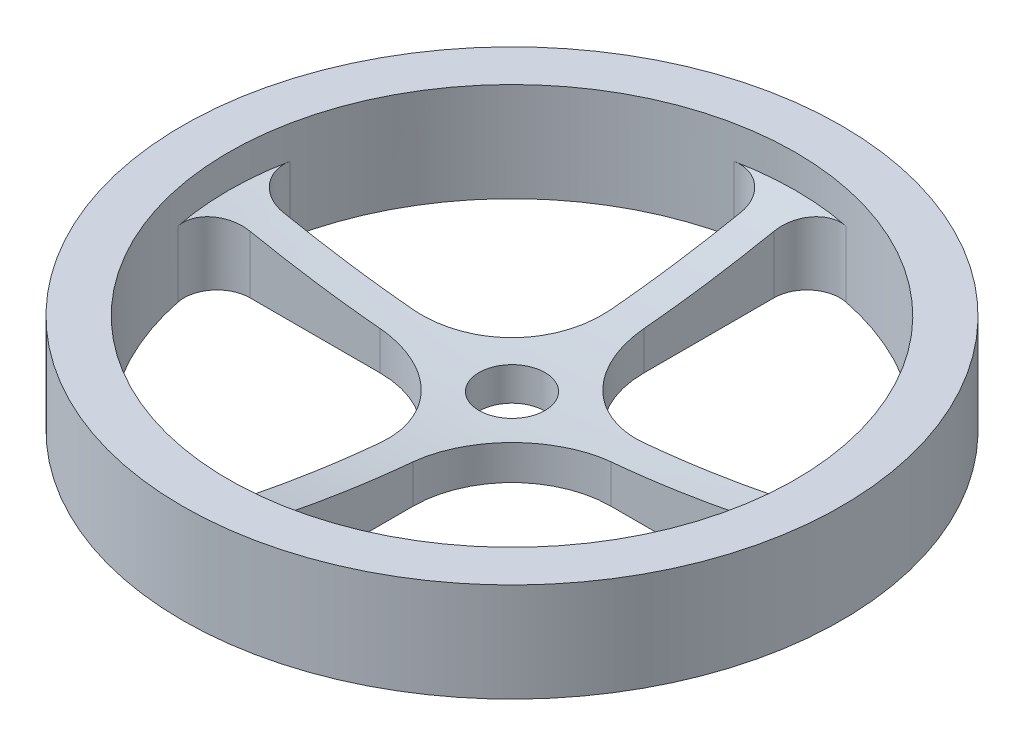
from build123d import *
from build123d.topology import SkipClean

# Parameters (mm, degrees)
SKETCH1_R          = 12.7
THREAD_BLANK_DEPTH = 3.81
VENT_DEPTH         = 19.360177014
SKETCH6_R          = 1.27
CENTER_HOLE_DEPTH  = 19.360177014


with BuildPart() as part:
    # Sketch1 → Thread Blank (new body)
    with BuildSketch(Plane(origin=(0, 0, 0), x_dir=(1, 0, 0), z_dir=(0, 1, 0))):
        with Locations(Location((0, 0, 0), (0, 0, 90))):
            Circle(SKETCH1_R)
    extrude(amount=THREAD_BLANK_DEPTH)

    # Sketch4 → Center Depression (revolve, cut)
    with BuildSketch(Plane.XY, mode=Mode.PRIVATE) as center_depression_sk:
        with BuildLine():
            Line((0, 3.81), (10.922, 3.81))
            Line((10.922, 3.81), (10.922, 2.54))
            ThreePointArc((10.922, 2.54), (5.497794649, 1.588566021), (0, 1.27))
            Line((0, 1.27), (0, 3.81))
        make_face()
    revolve(center_depression_sk.sketch.rotate(Axis((0, 0, 0), (0, 1, 0)), 90), axis=Axis((0, 0, 0), (0, 1, 0)), mode=Mode.SUBTRACT)

    # Sketch5 → Vent (cut, through all)
    with SkipClean():  # the faces are left unmerged after this step: merging them gives an invalid solid
        with BuildSketch(Plane(origin=(0, 0, 0), x_dir=(1, 0, 0), z_dir=(0, 1, 0))):
            with BuildLine():
                Line((0.635, 9.46213924), (0.635, 4.445))
                ThreePointArc((0.635, 4.445), (1.750923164, 1.750923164), (4.445, 0.635))
                Line((4.445, 0.635), (9.46213924, 0.635))
                ThreePointArc((9.46213924, 0.635), (10.444797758, 1.100461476), (10.707157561, 2.155657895))
                ThreePointArc((10.707157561, 2.155657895), (7.723020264, 7.723020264), (2.155657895, 10.707157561))
                ThreePointArc((2.155657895, 10.707157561), (1.100461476, 10.444797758), (0.635, 9.46213924))
            make_face()
            with BuildLine():
                Line((-4.445, 0.635), (-9.46213924, 0.635))
                ThreePointArc((-9.46213924, 0.635), (-10.444797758, 1.100461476), (-10.707157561, 2.155657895))
                ThreePointArc((-10.707157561, 2.155657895), (-7.723020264, 7.723020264), (-2.155657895, 10.707157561))
                ThreePointArc((-2.155657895, 10.707157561), (-1.100461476, 10.444797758), (-0.635, 9.46213924))
                Line((-0.635, 9.46213924), (-0.635, 4.445))
                ThreePointArc((-0.635, 4.445), (-1.750923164, 1.750923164), (-4.445, 0.635))
            make_face()
            with BuildLine():
                Line((-0.635, -9.46213924), (-0.635, -4.445))
                ThreePointArc((-0.635, -4.445), (-1.750923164, -1.750923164), (-4.445, -0.635))
                Line((-4.445, -0.635), (-9.46213924, -0.635))
                ThreePointArc((-9.46213924, -0.635), (-10.444797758, -1.100461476), (-10.707157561, -2.155657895))
                ThreePointArc((-10.707157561, -2.155657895), (-7.723020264, -7.723020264), (-2.155657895, -10.707157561))
                ThreePointArc((-2.155657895, -10.707157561), (-1.100461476, -10.444797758), (-0.635, -9.46213924))
            make_face()
            with BuildLine():
                Line((4.445, -0.635), (9.46213924, -0.635))
                ThreePointArc((9.46213924, -0.635), (10.444797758, -1.100461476), (10.707157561, -2.155657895))
                ThreePointArc((10.707157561, -2.155657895), (7.723020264, -7.723020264), (2.155657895, -10.707157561))
                ThreePointArc((2.155657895, -10.707157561), (1.100461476, -10.444797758), (0.635, -9.46213924))
                Line((0.635, -9.46213924), (0.635, -4.445))
                ThreePointArc((0.635, -4.445), (1.750923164, -1.750923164), (4.445, -0.635))
            make_face()
        extrude(amount=VENT_DEPTH, mode=Mode.SUBTRACT)

    # Sketch6 → Center Hole (cut, through all)
    with SkipClean():  # the faces are left unmerged after this step: merging them gives an invalid solid
        with BuildSketch(Plane(origin=(0, 0, 0), x_dir=(1, 0, 0), z_dir=(0, 1, 0))):
            with Locations(Location((0, 0, 0), (0, 0, 270))):
                Circle(SKETCH6_R)
        extrude(amount=CENTER_HOLE_DEPTH, mode=Mode.SUBTRACT)


solid = part.part
